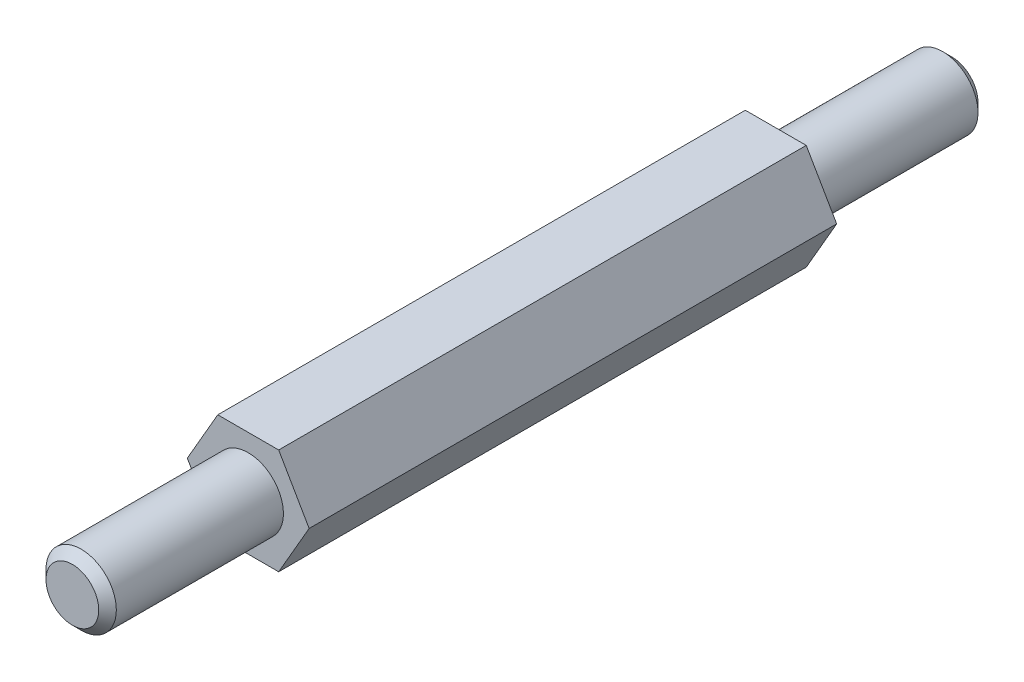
ISO-10303-21;
HEADER;
FILE_DESCRIPTION(('STEP AP214'),'2;1');
FILE_NAME('part.step','',(''),(''),'','','');
FILE_SCHEMA(('AUTOMOTIVE_DESIGN { 1 0 10303 214 1 1 1 1 }'));
ENDSEC;
DATA;
#1=APPLICATION_CONTEXT('core data for automotive mechanical design processes');
#2=APPLICATION_PROTOCOL_DEFINITION('international standard','automotive_design',2000,#1);
#3=PRODUCT_CONTEXT('',#1,'mechanical');
#4=PRODUCT('Part','Part','',(#3));
#5=PRODUCT_RELATED_PRODUCT_CATEGORY('part','',(#4));
#6=PRODUCT_DEFINITION_FORMATION('','',#4);
#7=PRODUCT_DEFINITION_CONTEXT('part definition',#1,'design');
#8=PRODUCT_DEFINITION('design','',#6,#7);
#9=PRODUCT_DEFINITION_SHAPE('','',#8);
#10=(LENGTH_UNIT() NAMED_UNIT(*) SI_UNIT(.MILLI.,.METRE.));
#11=(NAMED_UNIT(*) PLANE_ANGLE_UNIT() SI_UNIT($,.RADIAN.));
#12=(NAMED_UNIT(*) SI_UNIT($,.STERADIAN.) SOLID_ANGLE_UNIT());
#13=UNCERTAINTY_MEASURE_WITH_UNIT(LENGTH_MEASURE(1.E-05),#10,'distance_accuracy_value','');
#14=(GEOMETRIC_REPRESENTATION_CONTEXT(3) GLOBAL_UNCERTAINTY_ASSIGNED_CONTEXT((#13)) GLOBAL_UNIT_ASSIGNED_CONTEXT((#10,
#11,#12)) REPRESENTATION_CONTEXT('',''));
#15=CARTESIAN_POINT('',(0.,0.,0.));
#16=DIRECTION('',(0.,0.,1.));
#17=DIRECTION('',(1.,0.,0.));
#18=AXIS2_PLACEMENT_3D('',#15,#16,#17);
#19=CARTESIAN_POINT('',(-3.46410161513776,0.,0.));
#20=DIRECTION('',(0.,0.,-1.));
#21=DIRECTION('',(-1.,0.,0.));
#22=AXIS2_PLACEMENT_3D('',#19,#20,#21);
#23=PLANE('',#22);
#24=DIRECTION('',(0.5,-0.866025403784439,0.));
#25=VECTOR('',#24,1.);
#26=CARTESIAN_POINT('',(-1.73205080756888,-3.,0.));
#27=LINE('',#26,#25);
#28=CARTESIAN_POINT('',(-3.46410161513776,0.,0.));
#29=VERTEX_POINT('',#28);
#30=CARTESIAN_POINT('',(-1.73205080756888,-3.,0.));
#31=VERTEX_POINT('',#30);
#32=EDGE_CURVE('E119',#29,#31,#27,.T.);
#33=ORIENTED_EDGE('',*,*,#32,.F.);
#34=DIRECTION('',(-0.5,-0.866025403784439,0.));
#35=VECTOR('',#34,1.);
#36=CARTESIAN_POINT('',(-3.46410161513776,0.,0.));
#37=LINE('',#36,#35);
#38=CARTESIAN_POINT('',(-1.73205080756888,3.,0.));
#39=VERTEX_POINT('',#38);
#40=EDGE_CURVE('E78',#39,#29,#37,.T.);
#41=ORIENTED_EDGE('',*,*,#40,.F.);
#42=DIRECTION('',(-1.,0.,0.));
#43=VECTOR('',#42,1.);
#44=CARTESIAN_POINT('',(-1.73205080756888,3.,0.));
#45=LINE('',#44,#43);
#46=CARTESIAN_POINT('',(1.73205080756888,3.,0.));
#47=VERTEX_POINT('',#46);
#48=EDGE_CURVE('E72',#47,#39,#45,.T.);
#49=ORIENTED_EDGE('',*,*,#48,.F.);
#50=DIRECTION('',(-0.5,0.866025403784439,0.));
#51=VECTOR('',#50,1.);
#52=CARTESIAN_POINT('',(1.73205080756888,3.,0.));
#53=LINE('',#52,#51);
#54=CARTESIAN_POINT('',(3.46410161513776,0.,0.));
#55=VERTEX_POINT('',#54);
#56=EDGE_CURVE('E109',#55,#47,#53,.T.);
#57=ORIENTED_EDGE('',*,*,#56,.F.);
#58=DIRECTION('',(0.5,0.866025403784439,0.));
#59=VECTOR('',#58,1.);
#60=CARTESIAN_POINT('',(3.46410161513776,0.,0.));
#61=LINE('',#60,#59);
#62=CARTESIAN_POINT('',(1.73205080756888,-3.,0.));
#63=VERTEX_POINT('',#62);
#64=EDGE_CURVE('E125',#63,#55,#61,.T.);
#65=ORIENTED_EDGE('',*,*,#64,.F.);
#66=DIRECTION('',(1.,0.,0.));
#67=VECTOR('',#66,1.);
#68=CARTESIAN_POINT('',(1.73205080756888,-3.,0.));
#69=LINE('',#68,#67);
#70=EDGE_CURVE('E122',#31,#63,#69,.T.);
#71=ORIENTED_EDGE('',*,*,#70,.F.);
#72=EDGE_LOOP('',(#33,#41,#49,#57,#65,#71));
#73=FACE_BOUND('',#72,.T.);
#74=CARTESIAN_POINT('',(0.,0.,0.));
#75=DIRECTION('',(0.,0.,-1.));
#76=DIRECTION('',(-1.,0.,0.));
#77=AXIS2_PLACEMENT_3D('',#74,#75,#76);
#78=CIRCLE('',#77,2.);
#79=CARTESIAN_POINT('',(-2.,0.,0.));
#80=VERTEX_POINT('',#79);
#81=EDGE_CURVE('E123',#80,#80,#78,.T.);
#82=ORIENTED_EDGE('',*,*,#81,.F.);
#83=EDGE_LOOP('',(#82));
#84=FACE_BOUND('',#83,.T.);
#85=ADVANCED_FACE('F32',(#73,#84),#23,.T.);
#86=CARTESIAN_POINT('',(-3.46410161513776,0.,30.));
#87=DIRECTION('',(0.,0.,-1.));
#88=DIRECTION('',(-1.,0.,0.));
#89=AXIS2_PLACEMENT_3D('',#86,#87,#88);
#90=PLANE('',#89);
#91=DIRECTION('',(0.5,-0.866025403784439,0.));
#92=VECTOR('',#91,1.);
#93=CARTESIAN_POINT('',(-1.73205080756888,-3.,30.));
#94=LINE('',#93,#92);
#95=CARTESIAN_POINT('',(-3.46410161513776,0.,30.));
#96=VERTEX_POINT('',#95);
#97=CARTESIAN_POINT('',(-1.73205080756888,-3.,30.));
#98=VERTEX_POINT('',#97);
#99=EDGE_CURVE('E130',#96,#98,#94,.T.);
#100=ORIENTED_EDGE('',*,*,#99,.T.);
#101=DIRECTION('',(1.,0.,0.));
#102=VECTOR('',#101,1.);
#103=CARTESIAN_POINT('',(1.73205080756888,-3.,30.));
#104=LINE('',#103,#102);
#105=CARTESIAN_POINT('',(1.73205080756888,-3.,30.));
#106=VERTEX_POINT('',#105);
#107=EDGE_CURVE('E87',#98,#106,#104,.T.);
#108=ORIENTED_EDGE('',*,*,#107,.T.);
#109=DIRECTION('',(0.5,0.866025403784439,0.));
#110=VECTOR('',#109,1.);
#111=CARTESIAN_POINT('',(3.46410161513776,0.,30.));
#112=LINE('',#111,#110);
#113=CARTESIAN_POINT('',(3.46410161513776,0.,30.));
#114=VERTEX_POINT('',#113);
#115=EDGE_CURVE('E101',#106,#114,#112,.T.);
#116=ORIENTED_EDGE('',*,*,#115,.T.);
#117=DIRECTION('',(-0.5,0.866025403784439,0.));
#118=VECTOR('',#117,1.);
#119=CARTESIAN_POINT('',(1.73205080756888,3.,30.));
#120=LINE('',#119,#118);
#121=CARTESIAN_POINT('',(1.73205080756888,3.,30.));
#122=VERTEX_POINT('',#121);
#123=EDGE_CURVE('E94',#114,#122,#120,.T.);
#124=ORIENTED_EDGE('',*,*,#123,.T.);
#125=DIRECTION('',(-1.,0.,0.));
#126=VECTOR('',#125,1.);
#127=CARTESIAN_POINT('',(-1.73205080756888,3.,30.));
#128=LINE('',#127,#126);
#129=CARTESIAN_POINT('',(-1.73205080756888,3.,30.));
#130=VERTEX_POINT('',#129);
#131=EDGE_CURVE('E99',#122,#130,#128,.T.);
#132=ORIENTED_EDGE('',*,*,#131,.T.);
#133=DIRECTION('',(-0.5,-0.866025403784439,0.));
#134=VECTOR('',#133,1.);
#135=CARTESIAN_POINT('',(-3.46410161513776,0.,30.));
#136=LINE('',#135,#134);
#137=EDGE_CURVE('E49',#130,#96,#136,.T.);
#138=ORIENTED_EDGE('',*,*,#137,.T.);
#139=EDGE_LOOP('',(#100,#108,#116,#124,#132,#138));
#140=FACE_BOUND('',#139,.T.);
#141=CARTESIAN_POINT('',(0.,0.,30.));
#142=DIRECTION('',(0.,0.,-1.));
#143=DIRECTION('',(-1.,0.,0.));
#144=AXIS2_PLACEMENT_3D('',#141,#142,#143);
#145=CIRCLE('',#144,2.);
#146=CARTESIAN_POINT('',(-2.,0.,30.));
#147=VERTEX_POINT('',#146);
#148=EDGE_CURVE('E139',#147,#147,#145,.F.);
#149=ORIENTED_EDGE('',*,*,#148,.F.);
#150=EDGE_LOOP('',(#149));
#151=FACE_BOUND('',#150,.T.);
#152=ADVANCED_FACE('F96',(#140,#151),#90,.F.);
#153=CARTESIAN_POINT('',(-1.73205080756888,-3.,30.));
#154=DIRECTION('',(0.866025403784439,0.5,0.));
#155=DIRECTION('',(-0.5,0.866025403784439,0.));
#156=AXIS2_PLACEMENT_3D('',#153,#154,#155);
#157=PLANE('',#156);
#158=ORIENTED_EDGE('',*,*,#32,.T.);
#159=DIRECTION('',(0.,0.,-1.));
#160=VECTOR('',#159,1.);
#161=CARTESIAN_POINT('',(-1.73205080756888,-3.,30.));
#162=LINE('',#161,#160);
#163=EDGE_CURVE('E137',#98,#31,#162,.T.);
#164=ORIENTED_EDGE('',*,*,#163,.F.);
#165=ORIENTED_EDGE('',*,*,#99,.F.);
#166=DIRECTION('',(0.,0.,-1.));
#167=VECTOR('',#166,1.);
#168=CARTESIAN_POINT('',(-3.46410161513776,0.,30.));
#169=LINE('',#168,#167);
#170=EDGE_CURVE('E115',#96,#29,#169,.T.);
#171=ORIENTED_EDGE('',*,*,#170,.T.);
#172=EDGE_LOOP('',(#158,#164,#165,#171));
#173=FACE_BOUND('',#172,.T.);
#174=ADVANCED_FACE('F166',(#173),#157,.F.);
#175=CARTESIAN_POINT('',(1.73205080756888,-3.,30.));
#176=DIRECTION('',(0.,1.,0.));
#177=DIRECTION('',(0.,0.,1.));
#178=AXIS2_PLACEMENT_3D('',#175,#176,#177);
#179=PLANE('',#178);
#180=ORIENTED_EDGE('',*,*,#70,.T.);
#181=DIRECTION('',(0.,0.,-1.));
#182=VECTOR('',#181,1.);
#183=CARTESIAN_POINT('',(1.73205080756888,-3.,30.));
#184=LINE('',#183,#182);
#185=EDGE_CURVE('E134',#106,#63,#184,.T.);
#186=ORIENTED_EDGE('',*,*,#185,.F.);
#187=ORIENTED_EDGE('',*,*,#107,.F.);
#188=ORIENTED_EDGE('',*,*,#163,.T.);
#189=EDGE_LOOP('',(#180,#186,#187,#188));
#190=FACE_BOUND('',#189,.T.);
#191=ADVANCED_FACE('F183',(#190),#179,.F.);
#192=CARTESIAN_POINT('',(3.46410161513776,0.,30.));
#193=DIRECTION('',(-0.866025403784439,0.5,0.));
#194=DIRECTION('',(-0.5,-0.866025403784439,0.));
#195=AXIS2_PLACEMENT_3D('',#192,#193,#194);
#196=PLANE('',#195);
#197=ORIENTED_EDGE('',*,*,#64,.T.);
#198=DIRECTION('',(0.,0.,-1.));
#199=VECTOR('',#198,1.);
#200=CARTESIAN_POINT('',(3.46410161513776,0.,30.));
#201=LINE('',#200,#199);
#202=EDGE_CURVE('E110',#114,#55,#201,.T.);
#203=ORIENTED_EDGE('',*,*,#202,.F.);
#204=ORIENTED_EDGE('',*,*,#115,.F.);
#205=ORIENTED_EDGE('',*,*,#185,.T.);
#206=EDGE_LOOP('',(#197,#203,#204,#205));
#207=FACE_BOUND('',#206,.T.);
#208=ADVANCED_FACE('F180',(#207),#196,.F.);
#209=CARTESIAN_POINT('',(1.73205080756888,3.,30.));
#210=DIRECTION('',(-0.866025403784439,-0.5,0.));
#211=DIRECTION('',(0.5,-0.866025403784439,0.));
#212=AXIS2_PLACEMENT_3D('',#209,#210,#211);
#213=PLANE('',#212);
#214=ORIENTED_EDGE('',*,*,#56,.T.);
#215=DIRECTION('',(0.,0.,-1.));
#216=VECTOR('',#215,1.);
#217=CARTESIAN_POINT('',(1.73205080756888,3.,30.));
#218=LINE('',#217,#216);
#219=EDGE_CURVE('E106',#122,#47,#218,.T.);
#220=ORIENTED_EDGE('',*,*,#219,.F.);
#221=ORIENTED_EDGE('',*,*,#123,.F.);
#222=ORIENTED_EDGE('',*,*,#202,.T.);
#223=EDGE_LOOP('',(#214,#220,#221,#222));
#224=FACE_BOUND('',#223,.T.);
#225=ADVANCED_FACE('F107',(#224),#213,.F.);
#226=CARTESIAN_POINT('',(-1.73205080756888,3.,30.));
#227=DIRECTION('',(0.,-1.,0.));
#228=DIRECTION('',(0.,0.,-1.));
#229=AXIS2_PLACEMENT_3D('',#226,#227,#228);
#230=PLANE('',#229);
#231=ORIENTED_EDGE('',*,*,#48,.T.);
#232=DIRECTION('',(0.,0.,-1.));
#233=VECTOR('',#232,1.);
#234=CARTESIAN_POINT('',(-1.73205080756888,3.,30.));
#235=LINE('',#234,#233);
#236=EDGE_CURVE('E111',#130,#39,#235,.T.);
#237=ORIENTED_EDGE('',*,*,#236,.F.);
#238=ORIENTED_EDGE('',*,*,#131,.F.);
#239=ORIENTED_EDGE('',*,*,#219,.T.);
#240=EDGE_LOOP('',(#231,#237,#238,#239));
#241=FACE_BOUND('',#240,.T.);
#242=ADVANCED_FACE('F113',(#241),#230,.F.);
#243=CARTESIAN_POINT('',(-3.46410161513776,0.,30.));
#244=DIRECTION('',(0.866025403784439,-0.5,0.));
#245=DIRECTION('',(0.5,0.866025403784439,0.));
#246=AXIS2_PLACEMENT_3D('',#243,#244,#245);
#247=PLANE('',#246);
#248=ORIENTED_EDGE('',*,*,#40,.T.);
#249=ORIENTED_EDGE('',*,*,#170,.F.);
#250=ORIENTED_EDGE('',*,*,#137,.F.);
#251=ORIENTED_EDGE('',*,*,#236,.T.);
#252=EDGE_LOOP('',(#248,#249,#250,#251));
#253=FACE_BOUND('',#252,.T.);
#254=ADVANCED_FACE('F172',(#253),#247,.F.);
#255=CARTESIAN_POINT('',(0.,0.,40.));
#256=DIRECTION('',(0.,0.,-1.));
#257=DIRECTION('',(-1.,0.,0.));
#258=AXIS2_PLACEMENT_3D('',#255,#256,#257);
#259=CYLINDRICAL_SURFACE('',#258,2.);
#260=CARTESIAN_POINT('',(0.,0.,39.5));
#261=DIRECTION('',(0.,0.,1.));
#262=DIRECTION('',(1.,0.,0.));
#263=AXIS2_PLACEMENT_3D('',#260,#261,#262);
#264=CIRCLE('',#263,2.);
#265=CARTESIAN_POINT('',(2.,0.,39.5));
#266=VERTEX_POINT('',#265);
#267=EDGE_CURVE('E145',#266,#266,#264,.F.);
#268=ORIENTED_EDGE('',*,*,#267,.T.);
#269=EDGE_LOOP('',(#268));
#270=FACE_BOUND('',#269,.T.);
#271=ORIENTED_EDGE('',*,*,#148,.T.);
#272=EDGE_LOOP('',(#271));
#273=FACE_BOUND('',#272,.T.);
#274=ADVANCED_FACE('F175',(#270,#273),#259,.T.);
#275=CARTESIAN_POINT('',(0.,0.,40.));
#276=DIRECTION('',(0.,0.,1.));
#277=DIRECTION('',(1.,0.,0.));
#278=AXIS2_PLACEMENT_3D('',#275,#276,#277);
#279=PLANE('',#278);
#280=CARTESIAN_POINT('',(0.,0.,40.));
#281=DIRECTION('',(0.,0.,1.));
#282=DIRECTION('',(1.,0.,0.));
#283=AXIS2_PLACEMENT_3D('',#280,#281,#282);
#284=CIRCLE('',#283,1.5);
#285=CARTESIAN_POINT('',(1.5,0.,40.));
#286=VERTEX_POINT('',#285);
#287=EDGE_CURVE('E142',#286,#286,#284,.T.);
#288=ORIENTED_EDGE('',*,*,#287,.T.);
#289=EDGE_LOOP('',(#288));
#290=FACE_BOUND('',#289,.T.);
#291=ADVANCED_FACE('F202',(#290),#279,.T.);
#292=CARTESIAN_POINT('',(0.,0.,-10.));
#293=DIRECTION('',(0.,0.,1.));
#294=DIRECTION('',(1.,0.,0.));
#295=AXIS2_PLACEMENT_3D('',#292,#293,#294);
#296=CYLINDRICAL_SURFACE('',#295,2.);
#297=CARTESIAN_POINT('',(0.,0.,-9.5));
#298=DIRECTION('',(0.,0.,-1.));
#299=DIRECTION('',(-1.,0.,0.));
#300=AXIS2_PLACEMENT_3D('',#297,#298,#299);
#301=CIRCLE('',#300,2.);
#302=CARTESIAN_POINT('',(-2.,0.,-9.5));
#303=VERTEX_POINT('',#302);
#304=EDGE_CURVE('E11',#303,#303,#301,.F.);
#305=ORIENTED_EDGE('',*,*,#304,.T.);
#306=EDGE_LOOP('',(#305));
#307=FACE_BOUND('',#306,.T.);
#308=ORIENTED_EDGE('',*,*,#81,.T.);
#309=EDGE_LOOP('',(#308));
#310=FACE_BOUND('',#309,.T.);
#311=ADVANCED_FACE('F200',(#307,#310),#296,.T.);
#312=CARTESIAN_POINT('',(0.,0.,-10.));
#313=DIRECTION('',(0.,0.,-1.));
#314=DIRECTION('',(-1.,0.,0.));
#315=AXIS2_PLACEMENT_3D('',#312,#313,#314);
#316=PLANE('',#315);
#317=CARTESIAN_POINT('',(0.,0.,-10.));
#318=DIRECTION('',(0.,0.,-1.));
#319=DIRECTION('',(-1.,0.,0.));
#320=AXIS2_PLACEMENT_3D('',#317,#318,#319);
#321=CIRCLE('',#320,1.5);
#322=CARTESIAN_POINT('',(-1.5,0.,-10.));
#323=VERTEX_POINT('',#322);
#324=EDGE_CURVE('E41',#323,#323,#321,.T.);
#325=ORIENTED_EDGE('',*,*,#324,.T.);
#326=EDGE_LOOP('',(#325));
#327=FACE_BOUND('',#326,.T.);
#328=ADVANCED_FACE('F150',(#327),#316,.T.);
#329=CARTESIAN_POINT('',(0.,0.,40.));
#330=DIRECTION('',(0.,0.,-1.));
#331=DIRECTION('',(-1.,0.,0.));
#332=AXIS2_PLACEMENT_3D('',#329,#330,#331);
#333=CONICAL_SURFACE('',#332,1.5,0.785398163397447);
#334=ORIENTED_EDGE('',*,*,#267,.F.);
#335=EDGE_LOOP('',(#334));
#336=FACE_BOUND('',#335,.T.);
#337=ORIENTED_EDGE('',*,*,#287,.F.);
#338=EDGE_LOOP('',(#337));
#339=FACE_BOUND('',#338,.T.);
#340=ADVANCED_FACE('F153',(#336,#339),#333,.T.);
#341=CARTESIAN_POINT('',(0.,0.,-10.));
#342=DIRECTION('',(0.,0.,1.));
#343=DIRECTION('',(1.,0.,0.));
#344=AXIS2_PLACEMENT_3D('',#341,#342,#343);
#345=CONICAL_SURFACE('',#344,1.5,0.785398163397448);
#346=ORIENTED_EDGE('',*,*,#304,.F.);
#347=EDGE_LOOP('',(#346));
#348=FACE_BOUND('',#347,.T.);
#349=ORIENTED_EDGE('',*,*,#324,.F.);
#350=EDGE_LOOP('',(#349));
#351=FACE_BOUND('',#350,.T.);
#352=ADVANCED_FACE('F34',(#348,#351),#345,.T.);
#353=CLOSED_SHELL('',(#85,#152,#174,#191,#208,#225,#242,#254,#274,#291,#311,#328,#340,#352));
#354=MANIFOLD_SOLID_BREP('B2',#353);
#355=ADVANCED_BREP_SHAPE_REPRESENTATION('',(#18,#354),#14);
#356=SHAPE_DEFINITION_REPRESENTATION(#9,#355);
ENDSEC;
END-ISO-10303-21;
